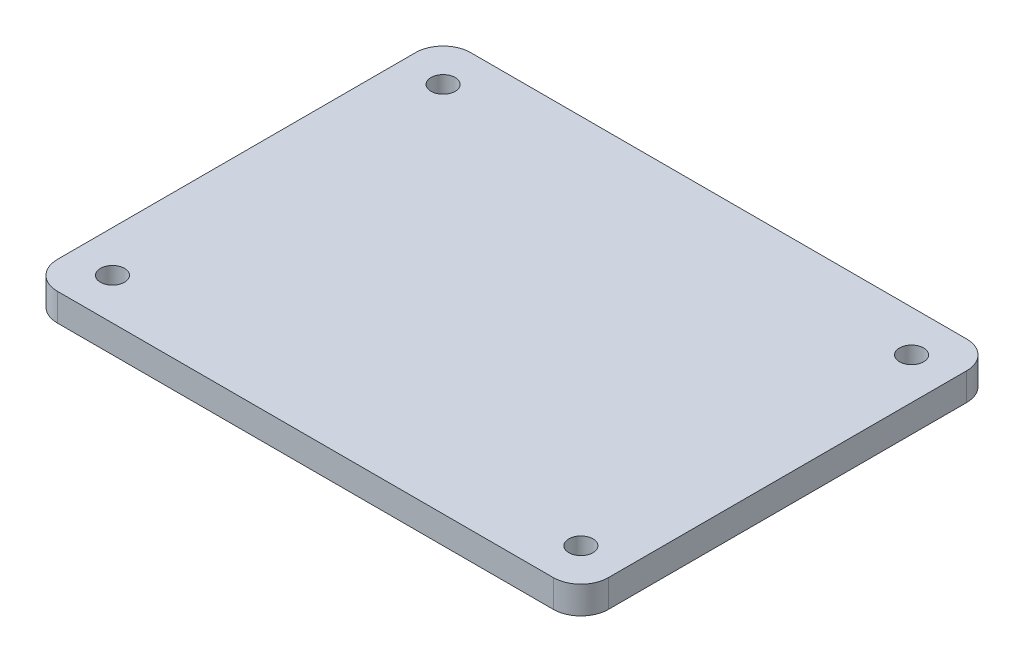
ISO-10303-21;
HEADER;
FILE_DESCRIPTION(('STEP AP214'),'2;1');
FILE_NAME('part.step','',(''),(''),'','','');
FILE_SCHEMA(('AUTOMOTIVE_DESIGN { 1 0 10303 214 1 1 1 1 }'));
ENDSEC;
DATA;
#1=APPLICATION_CONTEXT('core data for automotive mechanical design processes');
#2=APPLICATION_PROTOCOL_DEFINITION('international standard','automotive_design',2000,#1);
#3=PRODUCT_CONTEXT('',#1,'mechanical');
#4=PRODUCT('Part','Part','',(#3));
#5=PRODUCT_RELATED_PRODUCT_CATEGORY('part','',(#4));
#6=PRODUCT_DEFINITION_FORMATION('','',#4);
#7=PRODUCT_DEFINITION_CONTEXT('part definition',#1,'design');
#8=PRODUCT_DEFINITION('design','',#6,#7);
#9=PRODUCT_DEFINITION_SHAPE('','',#8);
#10=(LENGTH_UNIT() NAMED_UNIT(*) SI_UNIT(.MILLI.,.METRE.));
#11=(NAMED_UNIT(*) PLANE_ANGLE_UNIT() SI_UNIT($,.RADIAN.));
#12=(NAMED_UNIT(*) SI_UNIT($,.STERADIAN.) SOLID_ANGLE_UNIT());
#13=UNCERTAINTY_MEASURE_WITH_UNIT(LENGTH_MEASURE(1.E-05),#10,'distance_accuracy_value','');
#14=(GEOMETRIC_REPRESENTATION_CONTEXT(3) GLOBAL_UNCERTAINTY_ASSIGNED_CONTEXT((#13)) GLOBAL_UNIT_ASSIGNED_CONTEXT((#10,
#11,#12)) REPRESENTATION_CONTEXT('',''));
#15=CARTESIAN_POINT('',(0.,0.,0.));
#16=DIRECTION('',(0.,0.,1.));
#17=DIRECTION('',(1.,0.,0.));
#18=AXIS2_PLACEMENT_3D('',#15,#16,#17);
#19=CARTESIAN_POINT('',(-36.,4.,26.));
#20=DIRECTION('',(0.,1.,0.));
#21=DIRECTION('',(0.,0.,1.));
#22=AXIS2_PLACEMENT_3D('',#19,#20,#21);
#23=PLANE('',#22);
#24=CARTESIAN_POINT('',(34.,4.,24.));
#25=DIRECTION('',(0.,1.,0.));
#26=DIRECTION('',(0.,0.,1.));
#27=AXIS2_PLACEMENT_3D('',#24,#25,#26);
#28=CIRCLE('',#27,1.75);
#29=CARTESIAN_POINT('',(34.,4.,25.75));
#30=VERTEX_POINT('',#29);
#31=EDGE_CURVE('E188',#30,#30,#28,.T.);
#32=ORIENTED_EDGE('',*,*,#31,.F.);
#33=EDGE_LOOP('',(#32));
#34=FACE_BOUND('',#33,.T.);
#35=CARTESIAN_POINT('',(-34.,4.,-24.));
#36=DIRECTION('',(0.,1.,0.));
#37=DIRECTION('',(0.,0.,1.));
#38=AXIS2_PLACEMENT_3D('',#35,#36,#37);
#39=CIRCLE('',#38,1.75);
#40=CARTESIAN_POINT('',(-34.,4.,-22.25));
#41=VERTEX_POINT('',#40);
#42=EDGE_CURVE('E134',#41,#41,#39,.T.);
#43=ORIENTED_EDGE('',*,*,#42,.F.);
#44=EDGE_LOOP('',(#43));
#45=FACE_BOUND('',#44,.T.);
#46=CARTESIAN_POINT('',(-36.,4.,26.));
#47=DIRECTION('',(0.,1.,0.));
#48=DIRECTION('',(0.,0.,1.));
#49=AXIS2_PLACEMENT_3D('',#46,#47,#48);
#50=CIRCLE('',#49,4.);
#51=CARTESIAN_POINT('',(-40.,4.,26.));
#52=VERTEX_POINT('',#51);
#53=CARTESIAN_POINT('',(-36.,4.,30.));
#54=VERTEX_POINT('',#53);
#55=EDGE_CURVE('E145',#52,#54,#50,.T.);
#56=ORIENTED_EDGE('',*,*,#55,.T.);
#57=DIRECTION('',(1.,0.,0.));
#58=VECTOR('',#57,1.);
#59=CARTESIAN_POINT('',(-36.,4.,30.));
#60=LINE('',#59,#58);
#61=CARTESIAN_POINT('',(36.,4.,30.));
#62=VERTEX_POINT('',#61);
#63=EDGE_CURVE('E93',#54,#62,#60,.T.);
#64=ORIENTED_EDGE('',*,*,#63,.T.);
#65=CARTESIAN_POINT('',(36.,4.,26.));
#66=DIRECTION('',(0.,1.,0.));
#67=DIRECTION('',(0.,0.,1.));
#68=AXIS2_PLACEMENT_3D('',#65,#66,#67);
#69=CIRCLE('',#68,4.00000000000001);
#70=CARTESIAN_POINT('',(40.,4.,26.));
#71=VERTEX_POINT('',#70);
#72=EDGE_CURVE('E160',#62,#71,#69,.T.);
#73=ORIENTED_EDGE('',*,*,#72,.T.);
#74=DIRECTION('',(0.,0.,-1.));
#75=VECTOR('',#74,1.);
#76=CARTESIAN_POINT('',(40.,4.,-26.));
#77=LINE('',#76,#75);
#78=CARTESIAN_POINT('',(40.,4.,-26.));
#79=VERTEX_POINT('',#78);
#80=EDGE_CURVE('E173',#71,#79,#77,.T.);
#81=ORIENTED_EDGE('',*,*,#80,.T.);
#82=CARTESIAN_POINT('',(36.,4.,-26.));
#83=DIRECTION('',(0.,1.,0.));
#84=DIRECTION('',(0.,0.,1.));
#85=AXIS2_PLACEMENT_3D('',#82,#83,#84);
#86=CIRCLE('',#85,4.00000000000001);
#87=CARTESIAN_POINT('',(36.,4.,-30.));
#88=VERTEX_POINT('',#87);
#89=EDGE_CURVE('E112',#79,#88,#86,.T.);
#90=ORIENTED_EDGE('',*,*,#89,.T.);
#91=DIRECTION('',(-1.,0.,0.));
#92=VECTOR('',#91,1.);
#93=CARTESIAN_POINT('',(-36.,4.,-30.));
#94=LINE('',#93,#92);
#95=CARTESIAN_POINT('',(-36.,4.,-30.));
#96=VERTEX_POINT('',#95);
#97=EDGE_CURVE('E106',#88,#96,#94,.T.);
#98=ORIENTED_EDGE('',*,*,#97,.T.);
#99=CARTESIAN_POINT('',(-36.,4.,-26.));
#100=DIRECTION('',(0.,1.,0.));
#101=DIRECTION('',(0.,0.,1.));
#102=AXIS2_PLACEMENT_3D('',#99,#100,#101);
#103=CIRCLE('',#102,4.00000000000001);
#104=CARTESIAN_POINT('',(-40.,4.,-26.));
#105=VERTEX_POINT('',#104);
#106=EDGE_CURVE('E110',#96,#105,#103,.T.);
#107=ORIENTED_EDGE('',*,*,#106,.T.);
#108=DIRECTION('',(0.,0.,1.));
#109=VECTOR('',#108,1.);
#110=CARTESIAN_POINT('',(-40.,4.,-26.));
#111=LINE('',#110,#109);
#112=EDGE_CURVE('E50',#105,#52,#111,.T.);
#113=ORIENTED_EDGE('',*,*,#112,.T.);
#114=EDGE_LOOP('',(#56,#64,#73,#81,#90,#98,#107,#113));
#115=FACE_BOUND('',#114,.T.);
#116=CARTESIAN_POINT('',(34.,4.,-24.));
#117=DIRECTION('',(0.,1.,0.));
#118=DIRECTION('',(0.,0.,-1.));
#119=AXIS2_PLACEMENT_3D('',#116,#117,#118);
#120=CIRCLE('',#119,1.75);
#121=CARTESIAN_POINT('',(34.,4.,-25.75));
#122=VERTEX_POINT('',#121);
#123=EDGE_CURVE('E182',#122,#122,#120,.T.);
#124=ORIENTED_EDGE('',*,*,#123,.F.);
#125=EDGE_LOOP('',(#124));
#126=FACE_BOUND('',#125,.T.);
#127=CARTESIAN_POINT('',(-34.,4.,24.));
#128=DIRECTION('',(0.,1.,0.));
#129=DIRECTION('',(0.,0.,-1.));
#130=AXIS2_PLACEMENT_3D('',#127,#128,#129);
#131=CIRCLE('',#130,1.75);
#132=CARTESIAN_POINT('',(-34.,4.,22.25));
#133=VERTEX_POINT('',#132);
#134=EDGE_CURVE('E194',#133,#133,#131,.T.);
#135=ORIENTED_EDGE('',*,*,#134,.F.);
#136=EDGE_LOOP('',(#135));
#137=FACE_BOUND('',#136,.T.);
#138=ADVANCED_FACE('F33',(#34,#45,#115,#126,#137),#23,.T.);
#139=CARTESIAN_POINT('',(-36.,0.,26.));
#140=DIRECTION('',(0.,1.,0.));
#141=DIRECTION('',(0.,0.,1.));
#142=AXIS2_PLACEMENT_3D('',#139,#140,#141);
#143=PLANE('',#142);
#144=CARTESIAN_POINT('',(34.,0.,24.));
#145=DIRECTION('',(0.,1.,0.));
#146=DIRECTION('',(0.,0.,1.));
#147=AXIS2_PLACEMENT_3D('',#144,#145,#146);
#148=CIRCLE('',#147,1.75);
#149=CARTESIAN_POINT('',(34.,0.,25.75));
#150=VERTEX_POINT('',#149);
#151=EDGE_CURVE('E191',#150,#150,#148,.T.);
#152=ORIENTED_EDGE('',*,*,#151,.T.);
#153=EDGE_LOOP('',(#152));
#154=FACE_BOUND('',#153,.T.);
#155=CARTESIAN_POINT('',(-34.,0.,-24.));
#156=DIRECTION('',(0.,1.,0.));
#157=DIRECTION('',(0.,0.,1.));
#158=AXIS2_PLACEMENT_3D('',#155,#156,#157);
#159=CIRCLE('',#158,1.75);
#160=CARTESIAN_POINT('',(-34.,0.,-22.25));
#161=VERTEX_POINT('',#160);
#162=EDGE_CURVE('E179',#161,#161,#159,.T.);
#163=ORIENTED_EDGE('',*,*,#162,.T.);
#164=EDGE_LOOP('',(#163));
#165=FACE_BOUND('',#164,.T.);
#166=CARTESIAN_POINT('',(-36.,0.,26.));
#167=DIRECTION('',(0.,1.,0.));
#168=DIRECTION('',(0.,0.,1.));
#169=AXIS2_PLACEMENT_3D('',#166,#167,#168);
#170=CIRCLE('',#169,4.);
#171=CARTESIAN_POINT('',(-40.,0.,26.));
#172=VERTEX_POINT('',#171);
#173=CARTESIAN_POINT('',(-36.,0.,30.));
#174=VERTEX_POINT('',#173);
#175=EDGE_CURVE('E130',#172,#174,#170,.T.);
#176=ORIENTED_EDGE('',*,*,#175,.F.);
#177=DIRECTION('',(0.,0.,1.));
#178=VECTOR('',#177,1.);
#179=CARTESIAN_POINT('',(-40.,0.,-26.));
#180=LINE('',#179,#178);
#181=CARTESIAN_POINT('',(-40.,0.,-26.));
#182=VERTEX_POINT('',#181);
#183=EDGE_CURVE('E85',#182,#172,#180,.T.);
#184=ORIENTED_EDGE('',*,*,#183,.F.);
#185=CARTESIAN_POINT('',(-36.,0.,-26.));
#186=DIRECTION('',(0.,1.,0.));
#187=DIRECTION('',(0.,0.,1.));
#188=AXIS2_PLACEMENT_3D('',#185,#186,#187);
#189=CIRCLE('',#188,4.00000000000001);
#190=CARTESIAN_POINT('',(-36.,0.,-30.));
#191=VERTEX_POINT('',#190);
#192=EDGE_CURVE('E79',#191,#182,#189,.T.);
#193=ORIENTED_EDGE('',*,*,#192,.F.);
#194=DIRECTION('',(-1.,0.,0.));
#195=VECTOR('',#194,1.);
#196=CARTESIAN_POINT('',(-36.,0.,-30.));
#197=LINE('',#196,#195);
#198=CARTESIAN_POINT('',(36.,0.,-30.));
#199=VERTEX_POINT('',#198);
#200=EDGE_CURVE('E120',#199,#191,#197,.T.);
#201=ORIENTED_EDGE('',*,*,#200,.F.);
#202=CARTESIAN_POINT('',(36.,0.,-26.));
#203=DIRECTION('',(0.,1.,0.));
#204=DIRECTION('',(0.,0.,1.));
#205=AXIS2_PLACEMENT_3D('',#202,#203,#204);
#206=CIRCLE('',#205,4.00000000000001);
#207=CARTESIAN_POINT('',(40.,0.,-26.));
#208=VERTEX_POINT('',#207);
#209=EDGE_CURVE('E140',#208,#199,#206,.T.);
#210=ORIENTED_EDGE('',*,*,#209,.F.);
#211=DIRECTION('',(0.,0.,-1.));
#212=VECTOR('',#211,1.);
#213=CARTESIAN_POINT('',(40.,0.,-26.));
#214=LINE('',#213,#212);
#215=CARTESIAN_POINT('',(40.,0.,26.));
#216=VERTEX_POINT('',#215);
#217=EDGE_CURVE('E138',#216,#208,#214,.T.);
#218=ORIENTED_EDGE('',*,*,#217,.F.);
#219=CARTESIAN_POINT('',(36.,0.,26.));
#220=DIRECTION('',(0.,1.,0.));
#221=DIRECTION('',(0.,0.,1.));
#222=AXIS2_PLACEMENT_3D('',#219,#220,#221);
#223=CIRCLE('',#222,4.00000000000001);
#224=CARTESIAN_POINT('',(36.,0.,30.));
#225=VERTEX_POINT('',#224);
#226=EDGE_CURVE('E136',#225,#216,#223,.T.);
#227=ORIENTED_EDGE('',*,*,#226,.F.);
#228=DIRECTION('',(1.,0.,0.));
#229=VECTOR('',#228,1.);
#230=CARTESIAN_POINT('',(-36.,0.,30.));
#231=LINE('',#230,#229);
#232=EDGE_CURVE('E133',#174,#225,#231,.T.);
#233=ORIENTED_EDGE('',*,*,#232,.F.);
#234=EDGE_LOOP('',(#176,#184,#193,#201,#210,#218,#227,#233));
#235=FACE_BOUND('',#234,.T.);
#236=CARTESIAN_POINT('',(34.,0.,-24.));
#237=DIRECTION('',(0.,1.,0.));
#238=DIRECTION('',(0.,0.,-1.));
#239=AXIS2_PLACEMENT_3D('',#236,#237,#238);
#240=CIRCLE('',#239,1.75);
#241=CARTESIAN_POINT('',(34.,0.,-25.75));
#242=VERTEX_POINT('',#241);
#243=EDGE_CURVE('E185',#242,#242,#240,.T.);
#244=ORIENTED_EDGE('',*,*,#243,.T.);
#245=EDGE_LOOP('',(#244));
#246=FACE_BOUND('',#245,.T.);
#247=CARTESIAN_POINT('',(-34.,0.,24.));
#248=DIRECTION('',(0.,1.,0.));
#249=DIRECTION('',(0.,0.,-1.));
#250=AXIS2_PLACEMENT_3D('',#247,#248,#249);
#251=CIRCLE('',#250,1.75);
#252=CARTESIAN_POINT('',(-34.,0.,22.25));
#253=VERTEX_POINT('',#252);
#254=EDGE_CURVE('E197',#253,#253,#251,.T.);
#255=ORIENTED_EDGE('',*,*,#254,.T.);
#256=EDGE_LOOP('',(#255));
#257=FACE_BOUND('',#256,.T.);
#258=ADVANCED_FACE('F164',(#154,#165,#235,#246,#257),#143,.F.);
#259=CARTESIAN_POINT('',(-36.,4.,26.));
#260=DIRECTION('',(0.,-1.,0.));
#261=DIRECTION('',(0.,0.,-1.));
#262=AXIS2_PLACEMENT_3D('',#259,#260,#261);
#263=CYLINDRICAL_SURFACE('',#262,4.);
#264=ORIENTED_EDGE('',*,*,#175,.T.);
#265=DIRECTION('',(0.,-1.,0.));
#266=VECTOR('',#265,1.);
#267=CARTESIAN_POINT('',(-36.,4.,30.));
#268=LINE('',#267,#266);
#269=EDGE_CURVE('E11',#54,#174,#268,.T.);
#270=ORIENTED_EDGE('',*,*,#269,.F.);
#271=ORIENTED_EDGE('',*,*,#55,.F.);
#272=DIRECTION('',(0.,-1.,0.));
#273=VECTOR('',#272,1.);
#274=CARTESIAN_POINT('',(-40.,4.,26.));
#275=LINE('',#274,#273);
#276=EDGE_CURVE('E126',#52,#172,#275,.T.);
#277=ORIENTED_EDGE('',*,*,#276,.T.);
#278=EDGE_LOOP('',(#264,#270,#271,#277));
#279=FACE_BOUND('',#278,.T.);
#280=ADVANCED_FACE('F35',(#279),#263,.T.);
#281=CARTESIAN_POINT('',(-36.,4.,30.));
#282=DIRECTION('',(0.,0.,-1.));
#283=DIRECTION('',(-1.,0.,0.));
#284=AXIS2_PLACEMENT_3D('',#281,#282,#283);
#285=PLANE('',#284);
#286=ORIENTED_EDGE('',*,*,#232,.T.);
#287=DIRECTION('',(0.,-1.,0.));
#288=VECTOR('',#287,1.);
#289=CARTESIAN_POINT('',(36.,4.,30.));
#290=LINE('',#289,#288);
#291=EDGE_CURVE('E42',#62,#225,#290,.T.);
#292=ORIENTED_EDGE('',*,*,#291,.F.);
#293=ORIENTED_EDGE('',*,*,#63,.F.);
#294=ORIENTED_EDGE('',*,*,#269,.T.);
#295=EDGE_LOOP('',(#286,#292,#293,#294));
#296=FACE_BOUND('',#295,.T.);
#297=ADVANCED_FACE('F232',(#296),#285,.F.);
#298=CARTESIAN_POINT('',(36.,4.,26.));
#299=DIRECTION('',(0.,-1.,0.));
#300=DIRECTION('',(0.,0.,-1.));
#301=AXIS2_PLACEMENT_3D('',#298,#299,#300);
#302=CYLINDRICAL_SURFACE('',#301,4.00000000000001);
#303=ORIENTED_EDGE('',*,*,#226,.T.);
#304=DIRECTION('',(0.,-1.,0.));
#305=VECTOR('',#304,1.);
#306=CARTESIAN_POINT('',(40.,4.,26.));
#307=LINE('',#306,#305);
#308=EDGE_CURVE('E152',#71,#216,#307,.T.);
#309=ORIENTED_EDGE('',*,*,#308,.F.);
#310=ORIENTED_EDGE('',*,*,#72,.F.);
#311=ORIENTED_EDGE('',*,*,#291,.T.);
#312=EDGE_LOOP('',(#303,#309,#310,#311));
#313=FACE_BOUND('',#312,.T.);
#314=ADVANCED_FACE('F158',(#313),#302,.T.);
#315=CARTESIAN_POINT('',(40.,4.,-26.));
#316=DIRECTION('',(-1.,0.,0.));
#317=DIRECTION('',(0.,0.,1.));
#318=AXIS2_PLACEMENT_3D('',#315,#316,#317);
#319=PLANE('',#318);
#320=ORIENTED_EDGE('',*,*,#217,.T.);
#321=DIRECTION('',(0.,-1.,0.));
#322=VECTOR('',#321,1.);
#323=CARTESIAN_POINT('',(40.,4.,-26.));
#324=LINE('',#323,#322);
#325=EDGE_CURVE('E149',#79,#208,#324,.T.);
#326=ORIENTED_EDGE('',*,*,#325,.F.);
#327=ORIENTED_EDGE('',*,*,#80,.F.);
#328=ORIENTED_EDGE('',*,*,#308,.T.);
#329=EDGE_LOOP('',(#320,#326,#327,#328));
#330=FACE_BOUND('',#329,.T.);
#331=ADVANCED_FACE('F169',(#330),#319,.F.);
#332=CARTESIAN_POINT('',(36.,4.,-26.));
#333=DIRECTION('',(0.,-1.,0.));
#334=DIRECTION('',(0.,0.,-1.));
#335=AXIS2_PLACEMENT_3D('',#332,#333,#334);
#336=CYLINDRICAL_SURFACE('',#335,4.00000000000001);
#337=ORIENTED_EDGE('',*,*,#209,.T.);
#338=DIRECTION('',(0.,-1.,0.));
#339=VECTOR('',#338,1.);
#340=CARTESIAN_POINT('',(36.,4.,-30.));
#341=LINE('',#340,#339);
#342=EDGE_CURVE('E121',#88,#199,#341,.T.);
#343=ORIENTED_EDGE('',*,*,#342,.F.);
#344=ORIENTED_EDGE('',*,*,#89,.F.);
#345=ORIENTED_EDGE('',*,*,#325,.T.);
#346=EDGE_LOOP('',(#337,#343,#344,#345));
#347=FACE_BOUND('',#346,.T.);
#348=ADVANCED_FACE('F172',(#347),#336,.T.);
#349=CARTESIAN_POINT('',(-36.,4.,-30.));
#350=DIRECTION('',(0.,0.,1.));
#351=DIRECTION('',(1.,0.,0.));
#352=AXIS2_PLACEMENT_3D('',#349,#350,#351);
#353=PLANE('',#352);
#354=ORIENTED_EDGE('',*,*,#200,.T.);
#355=DIRECTION('',(0.,-1.,0.));
#356=VECTOR('',#355,1.);
#357=CARTESIAN_POINT('',(-36.,4.,-30.));
#358=LINE('',#357,#356);
#359=EDGE_CURVE('E117',#96,#191,#358,.T.);
#360=ORIENTED_EDGE('',*,*,#359,.F.);
#361=ORIENTED_EDGE('',*,*,#97,.F.);
#362=ORIENTED_EDGE('',*,*,#342,.T.);
#363=EDGE_LOOP('',(#354,#360,#361,#362));
#364=FACE_BOUND('',#363,.T.);
#365=ADVANCED_FACE('F118',(#364),#353,.F.);
#366=CARTESIAN_POINT('',(-36.,4.,-26.));
#367=DIRECTION('',(0.,-1.,0.));
#368=DIRECTION('',(0.,0.,-1.));
#369=AXIS2_PLACEMENT_3D('',#366,#367,#368);
#370=CYLINDRICAL_SURFACE('',#369,4.00000000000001);
#371=ORIENTED_EDGE('',*,*,#192,.T.);
#372=DIRECTION('',(0.,-1.,0.));
#373=VECTOR('',#372,1.);
#374=CARTESIAN_POINT('',(-40.,4.,-26.));
#375=LINE('',#374,#373);
#376=EDGE_CURVE('E122',#105,#182,#375,.T.);
#377=ORIENTED_EDGE('',*,*,#376,.F.);
#378=ORIENTED_EDGE('',*,*,#106,.F.);
#379=ORIENTED_EDGE('',*,*,#359,.T.);
#380=EDGE_LOOP('',(#371,#377,#378,#379));
#381=FACE_BOUND('',#380,.T.);
#382=ADVANCED_FACE('F124',(#381),#370,.T.);
#383=CARTESIAN_POINT('',(-40.,4.,-26.));
#384=DIRECTION('',(1.,0.,0.));
#385=DIRECTION('',(0.,0.,-1.));
#386=AXIS2_PLACEMENT_3D('',#383,#384,#385);
#387=PLANE('',#386);
#388=ORIENTED_EDGE('',*,*,#183,.T.);
#389=ORIENTED_EDGE('',*,*,#276,.F.);
#390=ORIENTED_EDGE('',*,*,#112,.F.);
#391=ORIENTED_EDGE('',*,*,#376,.T.);
#392=EDGE_LOOP('',(#388,#389,#390,#391));
#393=FACE_BOUND('',#392,.T.);
#394=ADVANCED_FACE('F220',(#393),#387,.F.);
#395=CARTESIAN_POINT('',(-34.,4.,-24.));
#396=DIRECTION('',(0.,-1.,0.));
#397=DIRECTION('',(0.,0.,-1.));
#398=AXIS2_PLACEMENT_3D('',#395,#396,#397);
#399=CYLINDRICAL_SURFACE('',#398,1.75);
#400=ORIENTED_EDGE('',*,*,#42,.T.);
#401=EDGE_LOOP('',(#400));
#402=FACE_BOUND('',#401,.T.);
#403=ORIENTED_EDGE('',*,*,#162,.F.);
#404=EDGE_LOOP('',(#403));
#405=FACE_BOUND('',#404,.T.);
#406=ADVANCED_FACE('F217',(#402,#405),#399,.F.);
#407=CARTESIAN_POINT('',(34.,4.,-24.));
#408=DIRECTION('',(0.,-1.,0.));
#409=DIRECTION('',(0.,0.,-1.));
#410=AXIS2_PLACEMENT_3D('',#407,#408,#409);
#411=CYLINDRICAL_SURFACE('',#410,1.75);
#412=ORIENTED_EDGE('',*,*,#123,.T.);
#413=EDGE_LOOP('',(#412));
#414=FACE_BOUND('',#413,.T.);
#415=ORIENTED_EDGE('',*,*,#243,.F.);
#416=EDGE_LOOP('',(#415));
#417=FACE_BOUND('',#416,.T.);
#418=ADVANCED_FACE('F296',(#414,#417),#411,.F.);
#419=CARTESIAN_POINT('',(34.,4.,24.));
#420=DIRECTION('',(0.,-1.,0.));
#421=DIRECTION('',(0.,0.,-1.));
#422=AXIS2_PLACEMENT_3D('',#419,#420,#421);
#423=CYLINDRICAL_SURFACE('',#422,1.75);
#424=ORIENTED_EDGE('',*,*,#31,.T.);
#425=EDGE_LOOP('',(#424));
#426=FACE_BOUND('',#425,.T.);
#427=ORIENTED_EDGE('',*,*,#151,.F.);
#428=EDGE_LOOP('',(#427));
#429=FACE_BOUND('',#428,.T.);
#430=ADVANCED_FACE('F304',(#426,#429),#423,.F.);
#431=CARTESIAN_POINT('',(-34.,4.,24.));
#432=DIRECTION('',(0.,-1.,0.));
#433=DIRECTION('',(0.,0.,-1.));
#434=AXIS2_PLACEMENT_3D('',#431,#432,#433);
#435=CYLINDRICAL_SURFACE('',#434,1.75);
#436=ORIENTED_EDGE('',*,*,#134,.T.);
#437=EDGE_LOOP('',(#436));
#438=FACE_BOUND('',#437,.T.);
#439=ORIENTED_EDGE('',*,*,#254,.F.);
#440=EDGE_LOOP('',(#439));
#441=FACE_BOUND('',#440,.T.);
#442=ADVANCED_FACE('F203',(#438,#441),#435,.F.);
#443=CLOSED_SHELL('',(#138,#258,#280,#297,#314,#331,#348,#365,#382,#394,#406,#418,#430,#442));
#444=MANIFOLD_SOLID_BREP('B2',#443);
#445=ADVANCED_BREP_SHAPE_REPRESENTATION('',(#18,#444),#14);
#446=SHAPE_DEFINITION_REPRESENTATION(#9,#445);
ENDSEC;
END-ISO-10303-21;
